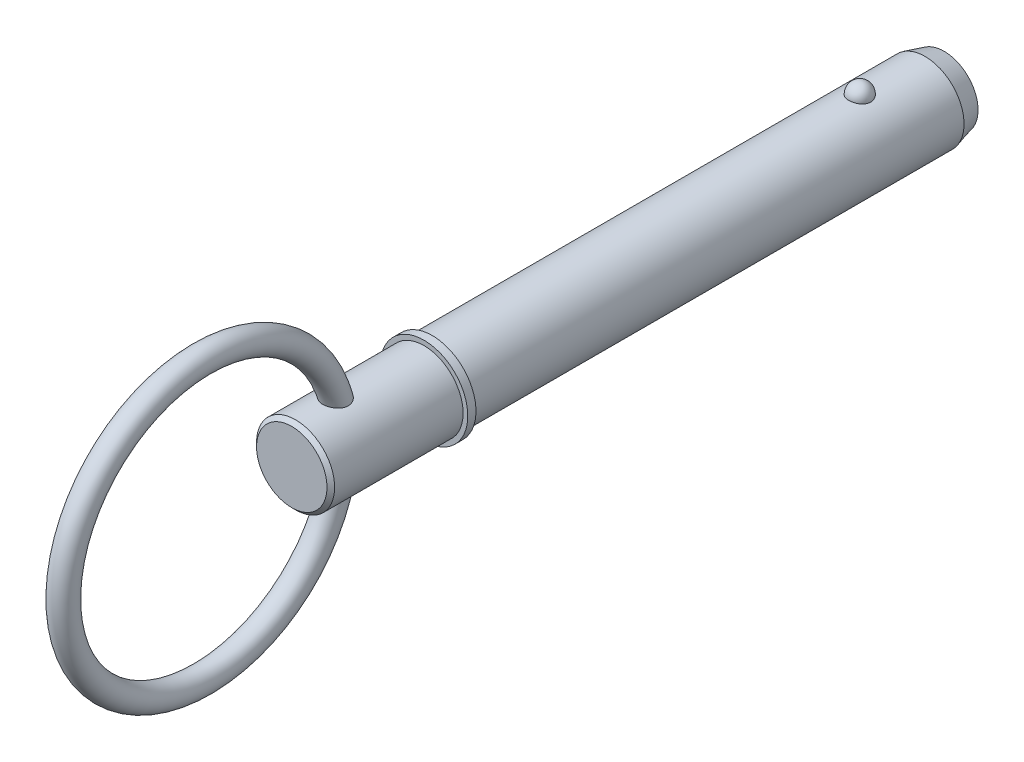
ISO-10303-21;
HEADER;
FILE_DESCRIPTION(('STEP AP214'),'2;1');
FILE_NAME('part.step','',(''),(''),'','','');
FILE_SCHEMA(('AUTOMOTIVE_DESIGN { 1 0 10303 214 1 1 1 1 }'));
ENDSEC;
DATA;
#1=APPLICATION_CONTEXT('core data for automotive mechanical design processes');
#2=APPLICATION_PROTOCOL_DEFINITION('international standard','automotive_design',2000,#1);
#3=PRODUCT_CONTEXT('',#1,'mechanical');
#4=PRODUCT('Part','Part','',(#3));
#5=PRODUCT_RELATED_PRODUCT_CATEGORY('part','',(#4));
#6=PRODUCT_DEFINITION_FORMATION('','',#4);
#7=PRODUCT_DEFINITION_CONTEXT('part definition',#1,'design');
#8=PRODUCT_DEFINITION('design','',#6,#7);
#9=PRODUCT_DEFINITION_SHAPE('','',#8);
#10=(LENGTH_UNIT() NAMED_UNIT(*) SI_UNIT(.MILLI.,.METRE.));
#11=(NAMED_UNIT(*) PLANE_ANGLE_UNIT() SI_UNIT($,.RADIAN.));
#12=(NAMED_UNIT(*) SI_UNIT($,.STERADIAN.) SOLID_ANGLE_UNIT());
#13=UNCERTAINTY_MEASURE_WITH_UNIT(LENGTH_MEASURE(1.E-05),#10,'distance_accuracy_value','');
#14=(GEOMETRIC_REPRESENTATION_CONTEXT(3) GLOBAL_UNCERTAINTY_ASSIGNED_CONTEXT((#13)) GLOBAL_UNIT_ASSIGNED_CONTEXT((#10,
#11,#12)) REPRESENTATION_CONTEXT('',''));
#15=CARTESIAN_POINT('',(0.,0.,0.));
#16=DIRECTION('',(0.,0.,1.));
#17=DIRECTION('',(1.,0.,0.));
#18=AXIS2_PLACEMENT_3D('',#15,#16,#17);
#19=CARTESIAN_POINT('',(0.,0.,76.2));
#20=DIRECTION('',(0.,0.,-1.));
#21=DIRECTION('',(-1.,0.,0.));
#22=AXIS2_PLACEMENT_3D('',#19,#20,#21);
#23=CYLINDRICAL_SURFACE('',#22,7.145);
#24=CARTESIAN_POINT('',(1.99971637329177,6.85945766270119,-2.02));
#25=CARTESIAN_POINT('',(1.9997145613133,6.85945924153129,-1.9070973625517));
#26=CARTESIAN_POINT('',(1.99051486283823,6.86216053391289,-1.79417185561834));
#27=CARTESIAN_POINT('',(1.95393597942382,6.87266409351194,-1.57152267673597));
#28=CARTESIAN_POINT('',(1.92655029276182,6.88046818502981,-1.46180016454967));
#29=CARTESIAN_POINT('',(1.85429435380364,6.90029063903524,-1.24873107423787));
#30=CARTESIAN_POINT('',(1.80943177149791,6.91230715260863,-1.14538172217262));
#31=CARTESIAN_POINT('',(1.70333474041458,6.93921158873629,-0.947875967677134));
#32=CARTESIAN_POINT('',(1.64210059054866,6.95409945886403,-0.853719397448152));
#33=CARTESIAN_POINT('',(1.5044381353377,6.98517577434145,-0.676721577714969));
#34=CARTESIAN_POINT('',(1.42793505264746,7.00137037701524,-0.593939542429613));
#35=CARTESIAN_POINT('',(1.26189697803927,7.03319066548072,-0.442536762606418));
#36=CARTESIAN_POINT('',(1.17236198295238,7.04881635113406,-0.373916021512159));
#37=CARTESIAN_POINT('',(0.982932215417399,7.0777121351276,-0.252935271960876));
#38=CARTESIAN_POINT('',(0.883068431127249,7.09098897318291,-0.200528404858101));
#39=CARTESIAN_POINT('',(0.675560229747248,7.11375589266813,-0.113212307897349));
#40=CARTESIAN_POINT('',(0.567916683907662,7.12324639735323,-0.0783011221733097));
#41=CARTESIAN_POINT('',(0.350006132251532,7.13724173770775,-0.027470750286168));
#42=CARTESIAN_POINT('',(0.239822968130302,7.14183447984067,-0.0112162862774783));
#43=CARTESIAN_POINT('',(0.0181946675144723,7.14583597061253,0.0029679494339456));
#44=CARTESIAN_POINT('',(-0.0932503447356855,7.14524522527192,0.000899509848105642));
#45=CARTESIAN_POINT('',(-0.312527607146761,7.13899247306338,-0.0213331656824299));
#46=CARTESIAN_POINT('',(-0.420388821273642,7.13340426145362,-0.0412340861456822));
#47=CARTESIAN_POINT('',(-0.631141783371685,7.11785474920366,-0.0982040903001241));
#48=CARTESIAN_POINT('',(-0.734033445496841,7.10789337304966,-0.135273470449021));
#49=CARTESIAN_POINT('',(-0.932634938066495,7.08458058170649,-0.225826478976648));
#50=CARTESIAN_POINT('',(-1.02829911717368,7.07120963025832,-0.279405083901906));
#51=CARTESIAN_POINT('',(-1.20927180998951,7.04252043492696,-0.401457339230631));
#52=CARTESIAN_POINT('',(-1.29457925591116,7.02720199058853,-0.469932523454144));
#53=CARTESIAN_POINT('',(-1.45423311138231,6.995926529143,-0.62143818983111));
#54=CARTESIAN_POINT('',(-1.5283348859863,6.97996288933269,-0.704725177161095));
#55=CARTESIAN_POINT('',(-1.66169281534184,6.94942414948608,-0.882667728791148));
#56=CARTESIAN_POINT('',(-1.72094789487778,6.93484915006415,-0.977324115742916));
#57=CARTESIAN_POINT('',(-1.82375276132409,6.90853186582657,-1.17661373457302));
#58=CARTESIAN_POINT('',(-1.86711024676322,6.8968248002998,-1.28135093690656));
#59=CARTESIAN_POINT('',(-1.9360425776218,6.87779420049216,-1.49689986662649));
#60=CARTESIAN_POINT('',(-1.96161794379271,6.87047053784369,-1.60771141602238));
#61=CARTESIAN_POINT('',(-1.99427437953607,6.86106309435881,-1.83176258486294));
#62=CARTESIAN_POINT('',(-2.00143373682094,6.8589571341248,-1.94498985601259));
#63=CARTESIAN_POINT('',(-1.99730449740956,6.86016064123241,-2.17107603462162));
#64=CARTESIAN_POINT('',(-1.98601641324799,6.86346995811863,-2.28393495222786));
#65=CARTESIAN_POINT('',(-1.94538181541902,6.87509649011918,-2.5054843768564));
#66=CARTESIAN_POINT('',(-1.91612773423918,6.88338806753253,-2.61419321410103));
#67=CARTESIAN_POINT('',(-1.84036449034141,6.90402888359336,-2.8250124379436));
#68=CARTESIAN_POINT('',(-1.79385462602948,6.91637828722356,-2.92712255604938));
#69=CARTESIAN_POINT('',(-1.68442067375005,6.94384180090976,-3.12247704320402));
#70=CARTESIAN_POINT('',(-1.62140729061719,6.95897081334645,-3.21566929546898));
#71=CARTESIAN_POINT('',(-1.4806650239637,6.99026742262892,-3.38999412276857));
#72=CARTESIAN_POINT('',(-1.40293556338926,7.00643506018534,-3.47112622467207));
#73=CARTESIAN_POINT('',(-1.2344320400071,7.03807960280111,-3.61938672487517));
#74=CARTESIAN_POINT('',(-1.1436092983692,7.05355363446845,-3.68646046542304));
#75=CARTESIAN_POINT('',(-0.951591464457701,7.08201263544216,-3.80431973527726));
#76=CARTESIAN_POINT('',(-0.850397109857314,7.09499778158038,-3.85510642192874));
#77=CARTESIAN_POINT('',(-0.64182374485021,7.11687679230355,-3.93839532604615));
#78=CARTESIAN_POINT('',(-0.534539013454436,7.1258202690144,-3.97112042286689));
#79=CARTESIAN_POINT('',(-0.3157436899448,7.1388605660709,-4.01830716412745));
#80=CARTESIAN_POINT('',(-0.204233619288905,7.14295798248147,-4.0327710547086));
#81=CARTESIAN_POINT('',(0.0175518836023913,7.14582273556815,-4.04291389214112));
#82=CARTESIAN_POINT('',(0.127809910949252,7.14469090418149,-4.03894819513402));
#83=CARTESIAN_POINT('',(0.34604453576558,7.13745046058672,-4.01315850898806));
#84=CARTESIAN_POINT('',(0.454021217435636,7.13134203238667,-3.99133518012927));
#85=CARTESIAN_POINT('',(0.664227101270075,7.11483713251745,-3.93057164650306));
#86=CARTESIAN_POINT('',(0.766477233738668,7.10445761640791,-3.89169908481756));
#87=CARTESIAN_POINT('',(0.962929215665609,7.08050813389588,-3.79792023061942));
#88=CARTESIAN_POINT('',(1.05713054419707,7.06693796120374,-3.7430129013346));
#89=CARTESIAN_POINT('',(1.23644031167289,7.03780007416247,-3.61765173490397));
#90=CARTESIAN_POINT('',(1.32138387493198,7.0222044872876,-3.54696861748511));
#91=CARTESIAN_POINT('',(1.47830582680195,6.99085504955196,-3.39245228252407));
#92=CARTESIAN_POINT('',(1.55028198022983,6.97510117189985,-3.30861680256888));
#93=CARTESIAN_POINT('',(1.68063701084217,6.94485803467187,-3.12843058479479));
#94=CARTESIAN_POINT('',(1.73875175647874,6.93039619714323,-3.03188405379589));
#95=CARTESIAN_POINT('',(1.83823393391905,6.90467783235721,-2.83015210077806));
#96=CARTESIAN_POINT('',(1.87960712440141,6.89342020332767,-2.72496966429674));
#97=CARTESIAN_POINT('',(1.94111647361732,6.87633596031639,-2.52050234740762));
#98=CARTESIAN_POINT('',(1.96305249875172,6.87005682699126,-2.42179225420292));
#99=CARTESIAN_POINT('',(1.99235308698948,6.86161702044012,-2.22206084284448));
#100=CARTESIAN_POINT('',(1.99971799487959,6.85945624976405,-2.12103957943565));
#101=CARTESIAN_POINT('',(1.99971637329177,6.85945766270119,-2.02));
#102=B_SPLINE_CURVE_WITH_KNOTS('',3,(#24,#25,#26,#27,#28,#29,#30,#31,#32,#33,#34,#35,#36,#37,
#38,#39,#40,#41,#42,#43,#44,#45,#46,#47,#48,#49,#50,#51,#52,#53,#54,#55,#56,#57,#58,#59,#60,#61,
#62,#63,#64,#65,#66,#67,#68,#69,#70,#71,#72,#73,#74,#75,#76,#77,#78,#79,#80,#81,#82,#83,#84,#85,
#86,#87,#88,#89,#90,#91,#92,#93,#94,#95,#96,#97,#98,#99,#100,#101),.UNSPECIFIED.,.T.,.F.,(4,2,2,
2,2,2,2,2,2,2,2,2,2,2,2,2,2,2,2,2,2,2,2,2,2,2,2,2,2,2,2,2,2,2,2,2,2,2,4),(0.,0.338345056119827,
0.67681114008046,1.01512885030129,1.35344038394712,1.69345130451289,2.0334623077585,
2.37248128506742,2.71146235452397,3.04425125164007,3.37700766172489,3.70493009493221,
4.03285819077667,4.36270921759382,4.69259422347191,5.02887632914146,5.36518278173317,
5.70543263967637,6.04567253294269,6.38446363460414,6.72324532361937,7.06029846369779,
7.39736530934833,7.73629500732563,8.07523799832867,8.41547528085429,8.7556883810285,
9.09160363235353,9.42747756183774,9.75690239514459,10.0863150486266,10.4144324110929,
10.7425709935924,11.0758313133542,11.4091490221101,11.748385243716,12.0875046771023,
12.3903058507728,12.6930998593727),.UNSPECIFIED.);
#103=CARTESIAN_POINT('',(1.99971637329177,6.85945766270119,-2.02));
#104=VERTEX_POINT('',#103);
#105=EDGE_CURVE('E103',#104,#104,#102,.T.);
#106=ORIENTED_EDGE('',*,*,#105,.T.);
#107=EDGE_LOOP('',(#106));
#108=FACE_BOUND('',#107,.T.);
#109=CARTESIAN_POINT('',(0.,0.,-13.95));
#110=DIRECTION('',(0.,0.,-1.));
#111=DIRECTION('',(-1.,0.,0.));
#112=AXIS2_PLACEMENT_3D('',#109,#110,#111);
#113=CIRCLE('',#112,7.145);
#114=CARTESIAN_POINT('',(-7.145,0.,-13.95));
#115=VERTEX_POINT('',#114);
#116=EDGE_CURVE('E111',#115,#115,#113,.F.);
#117=ORIENTED_EDGE('',*,*,#116,.T.);
#118=EDGE_LOOP('',(#117));
#119=FACE_BOUND('',#118,.T.);
#120=CARTESIAN_POINT('',(0.,0.,76.2));
#121=DIRECTION('',(0.,0.,1.));
#122=DIRECTION('',(1.,0.,0.));
#123=AXIS2_PLACEMENT_3D('',#120,#121,#122);
#124=CIRCLE('',#123,7.145);
#125=CARTESIAN_POINT('',(7.145,0.,76.2));
#126=VERTEX_POINT('',#125);
#127=EDGE_CURVE('E109',#126,#126,#124,.T.);
#128=ORIENTED_EDGE('',*,*,#127,.F.);
#129=EDGE_LOOP('',(#128));
#130=FACE_BOUND('',#129,.T.);
#131=ADVANCED_FACE('F39',(#108,#119,#130),#23,.T.);
#132=CARTESIAN_POINT('',(0.,0.,-17.45));
#133=DIRECTION('',(0.,0.,-1.));
#134=DIRECTION('',(-1.,0.,0.));
#135=AXIS2_PLACEMENT_3D('',#132,#133,#134);
#136=PLANE('',#135);
#137=CARTESIAN_POINT('',(0.,0.,-17.45));
#138=DIRECTION('',(0.,0.,-1.));
#139=DIRECTION('',(-1.,0.,0.));
#140=AXIS2_PLACEMENT_3D('',#137,#138,#139);
#141=CIRCLE('',#140,6.20717782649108);
#142=CARTESIAN_POINT('',(-6.20717782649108,0.,-17.45));
#143=VERTEX_POINT('',#142);
#144=EDGE_CURVE('E143',#143,#143,#141,.T.);
#145=ORIENTED_EDGE('',*,*,#144,.T.);
#146=EDGE_LOOP('',(#145));
#147=FACE_BOUND('',#146,.T.);
#148=ADVANCED_FACE('F89',(#147),#136,.T.);
#149=CARTESIAN_POINT('',(0.,0.,-17.45));
#150=DIRECTION('',(0.,0.,1.));
#151=DIRECTION('',(1.,0.,0.));
#152=AXIS2_PLACEMENT_3D('',#149,#150,#151);
#153=CONICAL_SURFACE('',#152,6.20717782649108,0.26179938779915);
#154=ORIENTED_EDGE('',*,*,#116,.F.);
#155=EDGE_LOOP('',(#154));
#156=FACE_BOUND('',#155,.T.);
#157=ORIENTED_EDGE('',*,*,#144,.F.);
#158=EDGE_LOOP('',(#157));
#159=FACE_BOUND('',#158,.T.);
#160=ADVANCED_FACE('F95',(#156,#159),#153,.T.);
#161=CARTESIAN_POINT('',(0.,7.145,-2.02));
#162=DIRECTION('',(0.,1.,0.));
#163=DIRECTION('',(0.,0.,-1.));
#164=AXIS2_PLACEMENT_3D('',#161,#162,#163);
#165=SPHERICAL_SURFACE('',#164,2.02);
#166=ORIENTED_EDGE('',*,*,#105,.F.);
#167=EDGE_LOOP('',(#166));
#168=FACE_BOUND('',#167,.T.);
#169=ADVANCED_FACE('F114',(#168),#165,.T.);
#170=CARTESIAN_POINT('',(0.,0.,76.2));
#171=DIRECTION('',(0.,0.,-1.));
#172=DIRECTION('',(-1.,0.,0.));
#173=AXIS2_PLACEMENT_3D('',#170,#171,#172);
#174=PLANE('',#173);
#175=ORIENTED_EDGE('',*,*,#127,.T.);
#176=EDGE_LOOP('',(#175));
#177=FACE_BOUND('',#176,.T.);
#178=CARTESIAN_POINT('',(0.,0.,76.2));
#179=DIRECTION('',(0.,0.,-1.));
#180=DIRECTION('',(-1.,0.,0.));
#181=AXIS2_PLACEMENT_3D('',#178,#179,#180);
#182=CIRCLE('',#181,8.);
#183=CARTESIAN_POINT('',(-8.,0.,76.2));
#184=VERTEX_POINT('',#183);
#185=EDGE_CURVE('E110',#184,#184,#182,.T.);
#186=ORIENTED_EDGE('',*,*,#185,.T.);
#187=EDGE_LOOP('',(#186));
#188=FACE_BOUND('',#187,.T.);
#189=ADVANCED_FACE('F118',(#177,#188),#174,.T.);
#190=CARTESIAN_POINT('',(0.,0.,33.7287874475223));
#191=DIRECTION('',(0.,0.,-1.));
#192=DIRECTION('',(-1.,0.,0.));
#193=AXIS2_PLACEMENT_3D('',#190,#191,#192);
#194=CYLINDRICAL_SURFACE('',#193,8.);
#195=CARTESIAN_POINT('',(0.,0.,77.7));
#196=DIRECTION('',(0.,0.,-1.));
#197=DIRECTION('',(-1.,0.,0.));
#198=AXIS2_PLACEMENT_3D('',#195,#196,#197);
#199=CIRCLE('',#198,8.);
#200=CARTESIAN_POINT('',(-8.,0.,77.7));
#201=VERTEX_POINT('',#200);
#202=EDGE_CURVE('E135',#201,#201,#199,.T.);
#203=ORIENTED_EDGE('',*,*,#202,.T.);
#204=EDGE_LOOP('',(#203));
#205=FACE_BOUND('',#204,.T.);
#206=ORIENTED_EDGE('',*,*,#185,.F.);
#207=EDGE_LOOP('',(#206));
#208=FACE_BOUND('',#207,.T.);
#209=ADVANCED_FACE('F122',(#205,#208),#194,.T.);
#210=CARTESIAN_POINT('',(0.,8.,77.7));
#211=DIRECTION('',(0.,0.,1.));
#212=DIRECTION('',(1.,0.,0.));
#213=AXIS2_PLACEMENT_3D('',#210,#211,#212);
#214=PLANE('',#213);
#215=CARTESIAN_POINT('',(0.,0.,77.7));
#216=DIRECTION('',(0.,0.,1.));
#217=DIRECTION('',(1.,0.,0.));
#218=AXIS2_PLACEMENT_3D('',#215,#216,#217);
#219=CIRCLE('',#218,7.145);
#220=CARTESIAN_POINT('',(7.145,0.,77.7));
#221=VERTEX_POINT('',#220);
#222=EDGE_CURVE('E113',#221,#221,#219,.T.);
#223=ORIENTED_EDGE('',*,*,#222,.F.);
#224=EDGE_LOOP('',(#223));
#225=FACE_BOUND('',#224,.T.);
#226=ORIENTED_EDGE('',*,*,#202,.F.);
#227=EDGE_LOOP('',(#226));
#228=FACE_BOUND('',#227,.T.);
#229=ADVANCED_FACE('F86',(#225,#228),#214,.T.);
#230=CARTESIAN_POINT('',(0.,0.,101.9));
#231=DIRECTION('',(0.,0.,-1.));
#232=DIRECTION('',(-1.,0.,0.));
#233=AXIS2_PLACEMENT_3D('',#230,#231,#232);
#234=CYLINDRICAL_SURFACE('',#233,7.145);
#235=CARTESIAN_POINT('',(-1.03551034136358,-7.0695645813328,91.8302593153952));
#236=CARTESIAN_POINT('',(-0.923225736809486,-7.08601142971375,91.7744028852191));
#237=CARTESIAN_POINT('',(-0.806039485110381,-7.10042113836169,91.7278354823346));
#238=CARTESIAN_POINT('',(-0.565173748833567,-7.1236385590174,91.6542799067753));
#239=CARTESIAN_POINT('',(-0.441495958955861,-7.13244772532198,91.6272866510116));
#240=CARTESIAN_POINT('',(-0.191106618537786,-7.14354309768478,91.593450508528));
#241=CARTESIAN_POINT('',(-0.064394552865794,-7.14582818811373,91.586611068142));
#242=CARTESIAN_POINT('',(0.188443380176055,-7.14363337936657,91.5932414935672));
#243=CARTESIAN_POINT('',(0.314569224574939,-7.13915321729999,91.6067121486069));
#244=CARTESIAN_POINT('',(0.562499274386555,-7.12390574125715,91.6536416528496));
#245=CARTESIAN_POINT('',(0.684308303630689,-7.11314569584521,91.6870773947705));
#246=CARTESIAN_POINT('',(0.920329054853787,-7.08647538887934,91.773194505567));
#247=CARTESIAN_POINT('',(1.03454038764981,-7.07056486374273,91.8258768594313));
#248=CARTESIAN_POINT('',(1.25232634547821,-7.03526161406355,91.9494470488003));
#249=CARTESIAN_POINT('',(1.35588248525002,-7.01586299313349,92.0203658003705));
#250=CARTESIAN_POINT('',(1.54916093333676,-6.9757352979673,92.1787573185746));
#251=CARTESIAN_POINT('',(1.63888414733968,-6.95500631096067,92.2662290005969));
#252=CARTESIAN_POINT('',(1.80113983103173,-6.91475703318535,92.4547277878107));
#253=CARTESIAN_POINT('',(1.8738192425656,-6.89522757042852,92.5556263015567));
#254=CARTESIAN_POINT('',(2.00091178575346,-6.85942834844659,92.76884010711));
#255=CARTESIAN_POINT('',(2.05532963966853,-6.8431577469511,92.8811524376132));
#256=CARTESIAN_POINT('',(2.14350100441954,-6.81604873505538,93.1111948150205));
#257=CARTESIAN_POINT('',(2.17770329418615,-6.80509340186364,93.2287395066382));
#258=CARTESIAN_POINT('',(2.22691394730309,-6.7891497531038,93.468149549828));
#259=CARTESIAN_POINT('',(2.2419216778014,-6.7841616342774,93.5900150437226));
#260=CARTESIAN_POINT('',(2.25313992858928,-6.78044381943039,93.8358069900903));
#261=CARTESIAN_POINT('',(2.24917302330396,-6.78177319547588,93.9597420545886));
#262=CARTESIAN_POINT('',(2.22301329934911,-6.79039131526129,94.2054389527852));
#263=CARTESIAN_POINT('',(2.20081491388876,-6.79768187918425,94.3272001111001));
#264=CARTESIAN_POINT('',(2.13702421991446,-6.81801706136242,94.5752873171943));
#265=CARTESIAN_POINT('',(2.09404815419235,-6.83146790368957,94.7012230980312));
#266=CARTESIAN_POINT('',(1.9898638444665,-6.86253672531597,94.9448244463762));
#267=CARTESIAN_POINT('',(1.9286413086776,-6.88015796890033,95.0624834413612));
#268=CARTESIAN_POINT('',(1.78274362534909,-6.91947130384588,95.2974979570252));
#269=CARTESIAN_POINT('',(1.69640701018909,-6.94139021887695,95.4137892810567));
#270=CARTESIAN_POINT('',(1.50503944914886,-6.98537683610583,95.6297996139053));
#271=CARTESIAN_POINT('',(1.40001969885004,-7.00744444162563,95.729528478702));
#272=CARTESIAN_POINT('',(1.19221781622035,-7.04548349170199,95.893170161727));
#273=CARTESIAN_POINT('',(1.09203347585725,-7.06185586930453,95.9602859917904));
#274=CARTESIAN_POINT('',(0.88160718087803,-7.09119477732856,96.077337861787));
#275=CARTESIAN_POINT('',(0.771372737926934,-7.10416382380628,96.1272866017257));
#276=CARTESIAN_POINT('',(0.542622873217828,-7.12529560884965,96.207475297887));
#277=CARTESIAN_POINT('',(0.424058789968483,-7.13342692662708,96.2375865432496));
#278=CARTESIAN_POINT('',(0.183155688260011,-7.14366628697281,96.2753706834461));
#279=CARTESIAN_POINT('',(0.0608191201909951,-7.14577815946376,96.2830578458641));
#280=CARTESIAN_POINT('',(-0.16936769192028,-7.14381572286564,96.2758601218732));
#281=CARTESIAN_POINT('',(-0.27730825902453,-7.14040669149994,96.2634029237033));
#282=CARTESIAN_POINT('',(-0.489468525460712,-7.12900651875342,96.2211569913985));
#283=CARTESIAN_POINT('',(-0.593687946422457,-7.12101503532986,96.1913669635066));
#284=CARTESIAN_POINT('',(-0.796149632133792,-7.10123695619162,96.1159872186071));
#285=CARTESIAN_POINT('',(-0.894373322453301,-7.08943921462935,96.0703510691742));
#286=CARTESIAN_POINT('',(-1.08274371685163,-7.06312621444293,95.965336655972));
#287=CARTESIAN_POINT('',(-1.17288754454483,-7.04860999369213,95.9059535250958));
#288=CARTESIAN_POINT('',(-1.35484961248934,-7.01605385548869,95.7671134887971));
#289=CARTESIAN_POINT('',(-1.44541008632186,-6.99780069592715,95.6860611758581));
#290=CARTESIAN_POINT('',(-1.61364655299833,-6.96093393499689,95.5115990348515));
#291=CARTESIAN_POINT('',(-1.69131381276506,-6.94232009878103,95.4181809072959));
#292=CARTESIAN_POINT('',(-1.843300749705,-6.90364386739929,95.2066087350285));
#293=CARTESIAN_POINT('',(-1.91543090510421,-6.88377370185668,95.0868392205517));
#294=CARTESIAN_POINT('',(-2.0400294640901,-6.84788436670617,94.8368759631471));
#295=CARTESIAN_POINT('',(-2.09248830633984,-6.83186707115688,94.7066771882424));
#296=CARTESIAN_POINT('',(-2.17795964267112,-6.80511869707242,94.4325553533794));
#297=CARTESIAN_POINT('',(-2.20992909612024,-6.79467512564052,94.2882740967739));
#298=CARTESIAN_POINT('',(-2.24813111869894,-6.78213595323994,93.9959843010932));
#299=CARTESIAN_POINT('',(-2.25438316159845,-6.78003403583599,93.8479786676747));
#300=CARTESIAN_POINT('',(-2.24011368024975,-6.78475868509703,93.5654300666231));
#301=CARTESIAN_POINT('',(-2.22172362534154,-6.79087455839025,93.4307692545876));
#302=CARTESIAN_POINT('',(-2.16145328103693,-6.81029672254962,93.1673673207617));
#303=CARTESIAN_POINT('',(-2.11958615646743,-6.82359898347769,93.0386229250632));
#304=CARTESIAN_POINT('',(-2.01784121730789,-6.85433303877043,92.8022679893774));
#305=CARTESIAN_POINT('',(-1.9598239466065,-6.8713108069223,92.6937922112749));
#306=CARTESIAN_POINT('',(-1.82642155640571,-6.90796511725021,92.4885914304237));
#307=CARTESIAN_POINT('',(-1.75103235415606,-6.92764229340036,92.3918691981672));
#308=CARTESIAN_POINT('',(-1.57825515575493,-6.96911949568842,92.2054086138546));
#309=CARTESIAN_POINT('',(-1.47957996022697,-6.9909623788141,92.1168703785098));
#310=CARTESIAN_POINT('',(-1.26760341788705,-7.0324852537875,91.958840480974));
#311=CARTESIAN_POINT('',(-1.15429989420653,-7.05216492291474,91.8893516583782));
#312=CARTESIAN_POINT('',(-1.03551034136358,-7.0695645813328,91.8302593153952));
#313=B_SPLINE_CURVE_WITH_KNOTS('',3,(#235,#236,#237,#238,#239,#240,#241,#242,#243,#244,#245,
#246,#247,#248,#249,#250,#251,#252,#253,#254,#255,#256,#257,#258,#259,#260,#261,#262,#263,#264,
#265,#266,#267,#268,#269,#270,#271,#272,#273,#274,#275,#276,#277,#278,#279,#280,#281,#282,#283,
#284,#285,#286,#287,#288,#289,#290,#291,#292,#293,#294,#295,#296,#297,#298,#299,#300,#301,#302,
#303,#304,#305,#306,#307,#308,#309,#310,#311,#312),.UNSPECIFIED.,.T.,.F.,(4,2,2,2,2,2,2,2,2,2,2,
2,2,2,2,2,2,2,2,2,2,2,2,2,2,2,2,2,2,2,2,2,2,2,2,2,2,2,4),(0.,0.378979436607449,
0.757860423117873,1.13680619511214,1.51576669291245,1.89428943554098,2.2728315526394,
2.65201969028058,3.03118299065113,3.40694616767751,3.78261210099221,4.14959041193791,
4.5165808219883,4.88700951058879,5.25755134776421,5.65713708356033,6.05703662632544,
6.49445595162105,6.93161403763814,7.29520224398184,7.65852089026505,8.02417421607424,
8.38959483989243,8.71415763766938,9.03874466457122,9.36429093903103,9.68995264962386,
10.0572255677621,10.4247462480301,10.8465602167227,11.2685789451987,11.7106604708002,
12.152407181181,12.5583067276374,12.9639788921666,13.3347314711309,13.7055712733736,
14.1064462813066,14.5073810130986),.UNSPECIFIED.);
#314=CARTESIAN_POINT('',(-1.03551034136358,-7.0695645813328,91.8302593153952));
#315=VERTEX_POINT('',#314);
#316=EDGE_CURVE('E10',#315,#315,#313,.T.);
#317=ORIENTED_EDGE('',*,*,#316,.F.);
#318=EDGE_LOOP('',(#317));
#319=FACE_BOUND('',#318,.T.);
#320=CARTESIAN_POINT('',(-1.03551034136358,7.0695645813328,91.8302593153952));
#321=CARTESIAN_POINT('',(-1.14644953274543,7.05331457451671,91.885446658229));
#322=CARTESIAN_POINT('',(-1.25260902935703,7.03507806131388,91.9497022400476));
#323=CARTESIAN_POINT('',(-1.45240021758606,6.99656564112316,92.0949589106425));
#324=CARTESIAN_POINT('',(-1.54602879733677,6.97628922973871,92.1759641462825));
#325=CARTESIAN_POINT('',(-1.71815091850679,6.93590796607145,92.3529100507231));
#326=CARTESIAN_POINT('',(-1.79663177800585,6.91580327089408,92.4488631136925));
#327=CARTESIAN_POINT('',(-1.9360771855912,6.87807159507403,92.6531625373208));
#328=CARTESIAN_POINT('',(-1.99704642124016,6.86044395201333,92.7615055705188));
#329=CARTESIAN_POINT('',(-2.09894945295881,6.82995115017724,92.9855428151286));
#330=CARTESIAN_POINT('',(-2.14021253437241,6.81700866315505,93.1010768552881));
#331=CARTESIAN_POINT('',(-2.20347311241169,6.79682602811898,93.3377588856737));
#332=CARTESIAN_POINT('',(-2.22547114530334,6.78958572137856,93.4589067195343));
#333=CARTESIAN_POINT('',(-2.25026114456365,6.78140983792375,93.7032142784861));
#334=CARTESIAN_POINT('',(-2.25306986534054,6.78046876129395,93.8263721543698));
#335=CARTESIAN_POINT('',(-2.2403056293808,6.78469532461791,94.0716049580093));
#336=CARTESIAN_POINT('',(-2.22472720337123,6.78986478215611,94.1936795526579));
#337=CARTESIAN_POINT('',(-2.1747213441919,6.8060520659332,94.4420367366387));
#338=CARTESIAN_POINT('',(-2.13910164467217,6.81743831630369,94.5680537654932));
#339=CARTESIAN_POINT('',(-2.04975058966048,6.84483151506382,94.8129736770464));
#340=CARTESIAN_POINT('',(-1.99600968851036,6.86084089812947,94.9318727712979));
#341=CARTESIAN_POINT('',(-1.86558545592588,6.8975101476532,95.1714258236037));
#342=CARTESIAN_POINT('',(-1.78715729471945,6.91847353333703,95.2910877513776));
#343=CARTESIAN_POINT('',(-1.61149373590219,6.96148580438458,95.5156460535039));
#344=CARTESIAN_POINT('',(-1.51424701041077,6.98353533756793,95.6205334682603));
#345=CARTESIAN_POINT('',(-1.30107590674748,7.02639179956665,95.8129518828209));
#346=CARTESIAN_POINT('',(-1.1849228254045,7.04717858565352,95.9002366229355));
#347=CARTESIAN_POINT('',(-0.937392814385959,7.08434208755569,96.0508275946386));
#348=CARTESIAN_POINT('',(-0.80603962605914,7.10072555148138,96.1141705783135));
#349=CARTESIAN_POINT('',(-0.55047080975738,7.12475629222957,96.2054837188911));
#350=CARTESIAN_POINT('',(-0.427643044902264,7.13327781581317,96.2370470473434));
#351=CARTESIAN_POINT('',(-0.240556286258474,7.14122488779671,96.2663563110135));
#352=CARTESIAN_POINT('',(-0.177714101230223,7.14306799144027,96.2731199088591));
#353=CARTESIAN_POINT('',(-0.0516470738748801,7.14509121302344,96.2805390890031));
#354=CARTESIAN_POINT('',(0.0115777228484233,7.14527152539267,96.2811953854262));
#355=CARTESIAN_POINT('',(0.182932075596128,7.14347436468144,96.2746165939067));
#356=CARTESIAN_POINT('',(0.290871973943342,7.13986325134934,96.2614086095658));
#357=CARTESIAN_POINT('',(0.502842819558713,7.1280769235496,96.2176904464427));
#358=CARTESIAN_POINT('',(0.606873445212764,7.11990133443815,96.1871788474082));
#359=CARTESIAN_POINT('',(0.809001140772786,7.09978218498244,96.1103786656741));
#360=CARTESIAN_POINT('',(0.90707157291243,7.08782300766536,96.0640246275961));
#361=CARTESIAN_POINT('',(1.09503957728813,7.0612282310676,95.9576208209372));
#362=CARTESIAN_POINT('',(1.1849342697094,7.04659169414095,95.8975662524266));
#363=CARTESIAN_POINT('',(1.36644041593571,7.01380352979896,95.7572339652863));
#364=CARTESIAN_POINT('',(1.45676563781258,6.99544216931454,95.6753442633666));
#365=CARTESIAN_POINT('',(1.62440639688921,6.95842750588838,95.4992310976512));
#366=CARTESIAN_POINT('',(1.70171298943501,6.93977401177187,95.4049992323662));
#367=CARTESIAN_POINT('',(1.85271606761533,6.90111647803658,95.1918074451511));
#368=CARTESIAN_POINT('',(1.92421731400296,6.88131605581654,95.0712480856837));
#369=CARTESIAN_POINT('',(2.04739198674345,6.84567995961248,94.8197850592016));
#370=CARTESIAN_POINT('',(2.09905621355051,6.82984612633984,94.6888766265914));
#371=CARTESIAN_POINT('',(2.1825776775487,6.80363167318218,94.4138472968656));
#372=CARTESIAN_POINT('',(2.21345394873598,6.79352430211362,94.2693978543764));
#373=CARTESIAN_POINT('',(2.24941288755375,6.78170753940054,93.9769846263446));
#374=CARTESIAN_POINT('',(2.2545156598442,6.77999160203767,93.8290236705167));
#375=CARTESIAN_POINT('',(2.2380435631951,6.78544298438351,93.5470530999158));
#376=CARTESIAN_POINT('',(2.21864521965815,6.79188566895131,93.4129037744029));
#377=CARTESIAN_POINT('',(2.1564876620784,6.81187529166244,93.1506903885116));
#378=CARTESIAN_POINT('',(2.11373989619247,6.82541874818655,93.0226233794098));
#379=CARTESIAN_POINT('',(2.01040099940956,6.85652522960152,92.7875077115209));
#380=CARTESIAN_POINT('',(1.9516260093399,6.87365110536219,92.6795975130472));
#381=CARTESIAN_POINT('',(1.81683142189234,6.91050025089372,92.4756496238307));
#382=CARTESIAN_POINT('',(1.74081238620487,6.93022343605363,92.3796115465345));
#383=CARTESIAN_POINT('',(1.57431234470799,6.96992220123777,92.2025418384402));
#384=CARTESIAN_POINT('',(1.48394688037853,6.98989467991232,92.121400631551));
#385=CARTESIAN_POINT('',(1.29081365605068,7.02812243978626,91.9750381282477));
#386=CARTESIAN_POINT('',(1.18804491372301,7.04637758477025,91.9098180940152));
#387=CARTESIAN_POINT('',(0.970386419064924,7.07967210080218,91.7953776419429));
#388=CARTESIAN_POINT('',(0.855272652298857,7.09462807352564,91.7465586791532));
#389=CARTESIAN_POINT('',(0.618143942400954,7.11920826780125,91.6680711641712));
#390=CARTESIAN_POINT('',(0.496128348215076,7.12883198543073,91.6384044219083));
#391=CARTESIAN_POINT('',(0.247581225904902,7.14180209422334,91.5986987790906));
#392=CARTESIAN_POINT('',(0.121020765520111,7.14509609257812,91.5888236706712));
#393=CARTESIAN_POINT('',(-0.132022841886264,7.14489967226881,91.5894154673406));
#394=CARTESIAN_POINT('',(-0.258506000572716,7.14141109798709,91.5998768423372));
#395=CARTESIAN_POINT('',(-0.496649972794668,7.12862600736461,91.6390533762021));
#396=CARTESIAN_POINT('',(-0.608625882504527,7.11987587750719,91.6660553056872));
#397=CARTESIAN_POINT('',(-0.826925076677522,7.09783467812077,91.7362228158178));
#398=CARTESIAN_POINT('',(-0.93324832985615,7.08454358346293,91.7793884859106));
#399=CARTESIAN_POINT('',(-1.03551034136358,7.0695645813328,91.8302593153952));
#400=B_SPLINE_CURVE_WITH_KNOTS('',3,(#320,#321,#322,#323,#324,#325,#326,#327,#328,#329,#330,
#331,#332,#333,#334,#335,#336,#337,#338,#339,#340,#341,#342,#343,#344,#345,#346,#347,#348,#349,
#350,#351,#352,#353,#354,#355,#356,#357,#358,#359,#360,#361,#362,#363,#364,#365,#366,#367,#368,
#369,#370,#371,#372,#373,#374,#375,#376,#377,#378,#379,#380,#381,#382,#383,#384,#385,#386,#387,
#388,#389,#390,#391,#392,#393,#394,#395,#396,#397,#398,#399),.UNSPECIFIED.,.T.,.F.,(4,2,2,2,2,2,
2,2,2,2,2,2,2,2,2,2,2,2,2,2,2,2,2,2,2,2,2,2,2,2,2,2,2,2,2,2,2,2,2,4),(0.,0.374504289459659,
0.749101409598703,1.12401080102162,1.49881974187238,1.86712525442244,2.23542051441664,
2.60339417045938,2.97147730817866,3.36420696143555,3.75714381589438,4.18898920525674,
4.62109535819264,5.05888124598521,5.49599234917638,5.87475353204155,6.06416800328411,
6.25356032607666,6.57826179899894,6.90298992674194,7.22907626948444,7.55527703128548,
7.92373585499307,8.2924468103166,8.71527472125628,9.13829848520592,9.58009907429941,
10.0215549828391,10.4264139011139,10.831074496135,11.2014904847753,11.571894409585,
11.9394538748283,12.3070424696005,12.6830655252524,13.0591241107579,13.4382822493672,
13.8173372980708,14.1625475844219,14.5077597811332),.UNSPECIFIED.);
#401=CARTESIAN_POINT('',(-1.03551034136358,7.0695645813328,91.8302593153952));
#402=VERTEX_POINT('',#401);
#403=EDGE_CURVE('E51',#402,#402,#400,.T.);
#404=ORIENTED_EDGE('',*,*,#403,.F.);
#405=EDGE_LOOP('',(#404));
#406=FACE_BOUND('',#405,.T.);
#407=CARTESIAN_POINT('',(0.,0.,101.2));
#408=DIRECTION('',(0.,0.,-1.));
#409=DIRECTION('',(-1.,0.,0.));
#410=AXIS2_PLACEMENT_3D('',#407,#408,#409);
#411=CIRCLE('',#410,7.145);
#412=CARTESIAN_POINT('',(-7.145,0.,101.2));
#413=VERTEX_POINT('',#412);
#414=EDGE_CURVE('E65',#413,#413,#411,.T.);
#415=ORIENTED_EDGE('',*,*,#414,.T.);
#416=EDGE_LOOP('',(#415));
#417=FACE_BOUND('',#416,.T.);
#418=ORIENTED_EDGE('',*,*,#222,.T.);
#419=EDGE_LOOP('',(#418));
#420=FACE_BOUND('',#419,.T.);
#421=ADVANCED_FACE('F70',(#319,#406,#417,#420),#234,.T.);
#422=CARTESIAN_POINT('',(0.,0.,101.9));
#423=DIRECTION('',(0.,0.,-1.));
#424=DIRECTION('',(-1.,0.,0.));
#425=AXIS2_PLACEMENT_3D('',#422,#423,#424);
#426=PLANE('',#425);
#427=CARTESIAN_POINT('',(0.,0.,101.9));
#428=DIRECTION('',(0.,0.,-1.));
#429=DIRECTION('',(-1.,0.,0.));
#430=AXIS2_PLACEMENT_3D('',#427,#428,#429);
#431=CIRCLE('',#430,6.44499999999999);
#432=CARTESIAN_POINT('',(-6.44499999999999,0.,101.9));
#433=VERTEX_POINT('',#432);
#434=EDGE_CURVE('E58',#433,#433,#431,.F.);
#435=ORIENTED_EDGE('',*,*,#434,.T.);
#436=EDGE_LOOP('',(#435));
#437=FACE_BOUND('',#436,.T.);
#438=ADVANCED_FACE('F77',(#437),#426,.F.);
#439=CARTESIAN_POINT('',(0.,0.,101.2));
#440=DIRECTION('',(0.,0.,-1.));
#441=DIRECTION('',(-1.,0.,0.));
#442=AXIS2_PLACEMENT_3D('',#439,#440,#441);
#443=CONICAL_SURFACE('',#442,7.145,0.78539816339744);
#444=ORIENTED_EDGE('',*,*,#434,.F.);
#445=EDGE_LOOP('',(#444));
#446=FACE_BOUND('',#445,.T.);
#447=ORIENTED_EDGE('',*,*,#414,.F.);
#448=EDGE_LOOP('',(#447));
#449=FACE_BOUND('',#448,.T.);
#450=ADVANCED_FACE('F41',(#446,#449),#443,.T.);
#451=CARTESIAN_POINT('',(0.,0.,118.3));
#452=DIRECTION('',(1.,0.,0.));
#453=DIRECTION('',(0.,0.,-1.));
#454=AXIS2_PLACEMENT_3D('',#451,#452,#453);
#455=TOROIDAL_SURFACE('',#454,25.4,2.25);
#456=ORIENTED_EDGE('',*,*,#316,.T.);
#457=EDGE_LOOP('',(#456));
#458=FACE_BOUND('',#457,.T.);
#459=ORIENTED_EDGE('',*,*,#403,.T.);
#460=EDGE_LOOP('',(#459));
#461=FACE_BOUND('',#460,.T.);
#462=ADVANCED_FACE('F74',(#458,#461),#455,.T.);
#463=CLOSED_SHELL('',(#131,#148,#160,#169,#189,#209,#229,#421,#438,#450,#462));
#464=MANIFOLD_SOLID_BREP('B2',#463);
#465=ADVANCED_BREP_SHAPE_REPRESENTATION('',(#18,#464),#14);
#466=SHAPE_DEFINITION_REPRESENTATION(#9,#465);
ENDSEC;
END-ISO-10303-21;
